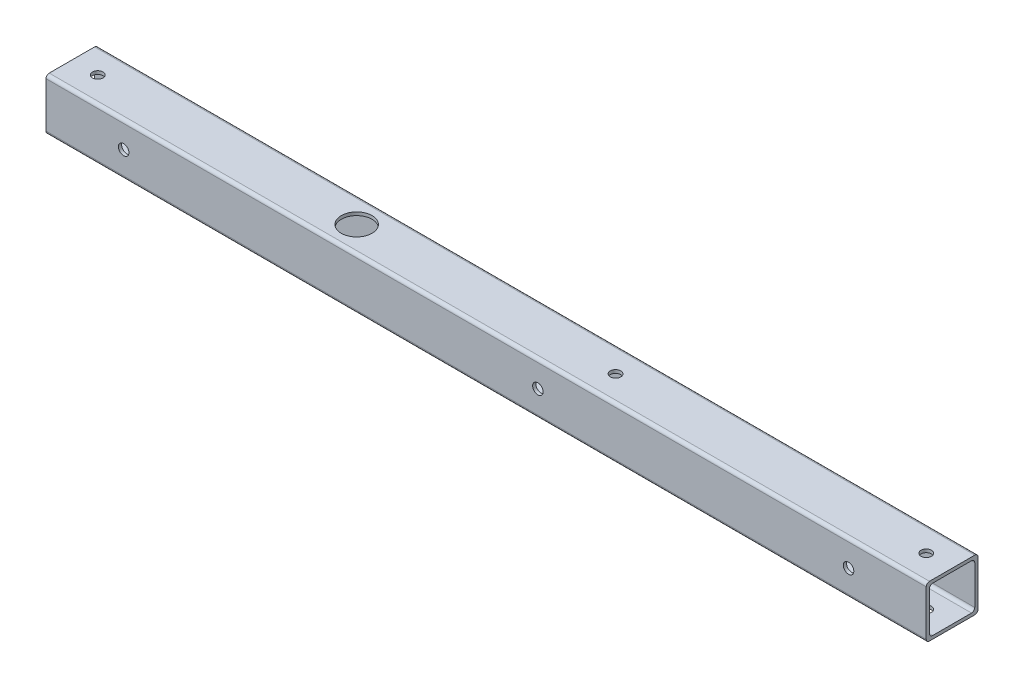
ISO-10303-21;
HEADER;
FILE_DESCRIPTION(('STEP AP214'),'2;1');
FILE_NAME('part.step','',(''),(''),'','','');
FILE_SCHEMA(('AUTOMOTIVE_DESIGN { 1 0 10303 214 1 1 1 1 }'));
ENDSEC;
DATA;
#1=APPLICATION_CONTEXT('core data for automotive mechanical design processes');
#2=APPLICATION_PROTOCOL_DEFINITION('international standard','automotive_design',2000,#1);
#3=PRODUCT_CONTEXT('',#1,'mechanical');
#4=PRODUCT('Part','Part','',(#3));
#5=PRODUCT_RELATED_PRODUCT_CATEGORY('part','',(#4));
#6=PRODUCT_DEFINITION_FORMATION('','',#4);
#7=PRODUCT_DEFINITION_CONTEXT('part definition',#1,'design');
#8=PRODUCT_DEFINITION('design','',#6,#7);
#9=PRODUCT_DEFINITION_SHAPE('','',#8);
#10=(LENGTH_UNIT() NAMED_UNIT(*) SI_UNIT(.MILLI.,.METRE.));
#11=(NAMED_UNIT(*) PLANE_ANGLE_UNIT() SI_UNIT($,.RADIAN.));
#12=(NAMED_UNIT(*) SI_UNIT($,.STERADIAN.) SOLID_ANGLE_UNIT());
#13=UNCERTAINTY_MEASURE_WITH_UNIT(LENGTH_MEASURE(1.E-05),#10,'distance_accuracy_value','');
#14=(GEOMETRIC_REPRESENTATION_CONTEXT(3) GLOBAL_UNCERTAINTY_ASSIGNED_CONTEXT((#13)) GLOBAL_UNIT_ASSIGNED_CONTEXT((#10,
#11,#12)) REPRESENTATION_CONTEXT('',''));
#15=CARTESIAN_POINT('',(0.,0.,0.));
#16=DIRECTION('',(0.,0.,1.));
#17=DIRECTION('',(1.,0.,0.));
#18=AXIS2_PLACEMENT_3D('',#15,#16,#17);
#19=CARTESIAN_POINT('',(0.,101.6,0.));
#20=DIRECTION('',(-1.,0.,0.));
#21=DIRECTION('',(0.,0.,1.));
#22=AXIS2_PLACEMENT_3D('',#19,#20,#21);
#23=PLANE('',#22);
#24=DIRECTION('',(0.,0.,1.));
#25=VECTOR('',#24,1.);
#26=CARTESIAN_POINT('',(0.,95.25,6.35000000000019));
#27=LINE('',#26,#25);
#28=CARTESIAN_POINT('',(0.,95.25,12.7000000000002));
#29=VERTEX_POINT('',#28);
#30=CARTESIAN_POINT('',(0.,95.25,88.9000000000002));
#31=VERTEX_POINT('',#30);
#32=EDGE_CURVE('E169',#29,#31,#27,.T.);
#33=ORIENTED_EDGE('',*,*,#32,.F.);
#34=CARTESIAN_POINT('',(0.,88.9,12.7000000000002));
#35=DIRECTION('',(-1.,0.,0.));
#36=DIRECTION('',(0.,0.,1.));
#37=AXIS2_PLACEMENT_3D('',#34,#35,#36);
#38=CIRCLE('',#37,6.35);
#39=CARTESIAN_POINT('',(0.,88.9,6.35000000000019));
#40=VERTEX_POINT('',#39);
#41=EDGE_CURVE('E179',#29,#40,#38,.T.);
#42=ORIENTED_EDGE('',*,*,#41,.T.);
#43=DIRECTION('',(0.,1.,0.));
#44=VECTOR('',#43,1.);
#45=CARTESIAN_POINT('',(0.,95.25,6.35000000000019));
#46=LINE('',#45,#44);
#47=CARTESIAN_POINT('',(0.,12.7,6.3500000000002));
#48=VERTEX_POINT('',#47);
#49=EDGE_CURVE('E264',#48,#40,#46,.T.);
#50=ORIENTED_EDGE('',*,*,#49,.F.);
#51=CARTESIAN_POINT('',(0.,12.7,12.7000000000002));
#52=DIRECTION('',(-1.,0.,0.));
#53=DIRECTION('',(0.,0.,1.));
#54=AXIS2_PLACEMENT_3D('',#51,#52,#53);
#55=CIRCLE('',#54,6.35);
#56=CARTESIAN_POINT('',(0.,6.35,12.7000000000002));
#57=VERTEX_POINT('',#56);
#58=EDGE_CURVE('E11',#48,#57,#55,.T.);
#59=ORIENTED_EDGE('',*,*,#58,.T.);
#60=DIRECTION('',(0.,0.,-1.));
#61=VECTOR('',#60,1.);
#62=CARTESIAN_POINT('',(0.,6.35,6.35000000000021));
#63=LINE('',#62,#61);
#64=CARTESIAN_POINT('',(0.,6.35,88.9000000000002));
#65=VERTEX_POINT('',#64);
#66=EDGE_CURVE('E277',#65,#57,#63,.T.);
#67=ORIENTED_EDGE('',*,*,#66,.F.);
#68=CARTESIAN_POINT('',(0.,12.7,88.9000000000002));
#69=DIRECTION('',(-1.,0.,0.));
#70=DIRECTION('',(0.,0.,1.));
#71=AXIS2_PLACEMENT_3D('',#68,#69,#70);
#72=CIRCLE('',#71,6.35);
#73=CARTESIAN_POINT('',(0.,12.7,95.2500000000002));
#74=VERTEX_POINT('',#73);
#75=EDGE_CURVE('E168',#65,#74,#72,.T.);
#76=ORIENTED_EDGE('',*,*,#75,.T.);
#77=DIRECTION('',(0.,-1.,0.));
#78=VECTOR('',#77,1.);
#79=CARTESIAN_POINT('',(0.,95.25,95.2500000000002));
#80=LINE('',#79,#78);
#81=CARTESIAN_POINT('',(0.,88.9,95.2500000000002));
#82=VERTEX_POINT('',#81);
#83=EDGE_CURVE('E152',#82,#74,#80,.T.);
#84=ORIENTED_EDGE('',*,*,#83,.F.);
#85=CARTESIAN_POINT('',(0.,88.9,88.9000000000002));
#86=DIRECTION('',(-1.,0.,0.));
#87=DIRECTION('',(0.,0.,1.));
#88=AXIS2_PLACEMENT_3D('',#85,#86,#87);
#89=CIRCLE('',#88,6.35);
#90=EDGE_CURVE('E164',#82,#31,#89,.T.);
#91=ORIENTED_EDGE('',*,*,#90,.T.);
#92=EDGE_LOOP('',(#33,#42,#50,#59,#67,#76,#84,#91));
#93=FACE_BOUND('',#92,.T.);
#94=DIRECTION('',(0.,-1.,0.));
#95=VECTOR('',#94,1.);
#96=CARTESIAN_POINT('',(0.,101.6,101.6));
#97=LINE('',#96,#95);
#98=CARTESIAN_POINT('',(0.,95.25,101.6));
#99=VERTEX_POINT('',#98);
#100=CARTESIAN_POINT('',(0.,6.34999999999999,101.6));
#101=VERTEX_POINT('',#100);
#102=EDGE_CURVE('E288',#99,#101,#97,.T.);
#103=ORIENTED_EDGE('',*,*,#102,.T.);
#104=CARTESIAN_POINT('',(0.,6.34999999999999,95.25));
#105=DIRECTION('',(-1.,0.,0.));
#106=DIRECTION('',(0.,0.,1.));
#107=AXIS2_PLACEMENT_3D('',#104,#105,#106);
#108=CIRCLE('',#107,6.35);
#109=CARTESIAN_POINT('',(0.,0.,95.25));
#110=VERTEX_POINT('',#109);
#111=EDGE_CURVE('E319',#101,#110,#108,.F.);
#112=ORIENTED_EDGE('',*,*,#111,.T.);
#113=DIRECTION('',(0.,0.,-1.));
#114=VECTOR('',#113,1.);
#115=CARTESIAN_POINT('',(0.,0.,0.));
#116=LINE('',#115,#114);
#117=CARTESIAN_POINT('',(0.,0.,6.35));
#118=VERTEX_POINT('',#117);
#119=EDGE_CURVE('E280',#110,#118,#116,.T.);
#120=ORIENTED_EDGE('',*,*,#119,.T.);
#121=CARTESIAN_POINT('',(0.,6.34999999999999,6.35));
#122=DIRECTION('',(-1.,0.,0.));
#123=DIRECTION('',(0.,0.,1.));
#124=AXIS2_PLACEMENT_3D('',#121,#122,#123);
#125=CIRCLE('',#124,6.35);
#126=CARTESIAN_POINT('',(0.,6.34999999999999,0.));
#127=VERTEX_POINT('',#126);
#128=EDGE_CURVE('E313',#118,#127,#125,.F.);
#129=ORIENTED_EDGE('',*,*,#128,.T.);
#130=DIRECTION('',(0.,-1.,0.));
#131=VECTOR('',#130,1.);
#132=CARTESIAN_POINT('',(0.,101.6,0.));
#133=LINE('',#132,#131);
#134=CARTESIAN_POINT('',(0.,95.25,0.));
#135=VERTEX_POINT('',#134);
#136=EDGE_CURVE('E159',#135,#127,#133,.T.);
#137=ORIENTED_EDGE('',*,*,#136,.F.);
#138=CARTESIAN_POINT('',(0.,95.25,6.35));
#139=DIRECTION('',(-1.,0.,0.));
#140=DIRECTION('',(0.,0.,1.));
#141=AXIS2_PLACEMENT_3D('',#138,#139,#140);
#142=CIRCLE('',#141,6.35);
#143=CARTESIAN_POINT('',(0.,101.6,6.35));
#144=VERTEX_POINT('',#143);
#145=EDGE_CURVE('E315',#135,#144,#142,.F.);
#146=ORIENTED_EDGE('',*,*,#145,.T.);
#147=DIRECTION('',(0.,0.,-1.));
#148=VECTOR('',#147,1.);
#149=CARTESIAN_POINT('',(0.,101.6,0.));
#150=LINE('',#149,#148);
#151=CARTESIAN_POINT('',(0.,101.6,95.25));
#152=VERTEX_POINT('',#151);
#153=EDGE_CURVE('E281',#152,#144,#150,.T.);
#154=ORIENTED_EDGE('',*,*,#153,.F.);
#155=CARTESIAN_POINT('',(0.,95.25,95.25));
#156=DIRECTION('',(-1.,0.,0.));
#157=DIRECTION('',(0.,0.,1.));
#158=AXIS2_PLACEMENT_3D('',#155,#156,#157);
#159=CIRCLE('',#158,6.35);
#160=EDGE_CURVE('E317',#152,#99,#159,.F.);
#161=ORIENTED_EDGE('',*,*,#160,.T.);
#162=EDGE_LOOP('',(#103,#112,#120,#129,#137,#146,#154,#161));
#163=FACE_BOUND('',#162,.T.);
#164=ADVANCED_FACE('F31',(#93,#163),#23,.F.);
#165=CARTESIAN_POINT('',(0.,101.6,0.));
#166=DIRECTION('',(0.,0.,1.));
#167=DIRECTION('',(1.,0.,0.));
#168=AXIS2_PLACEMENT_3D('',#165,#166,#167);
#169=PLANE('',#168);
#170=CARTESIAN_POINT('',(-762.,50.7999999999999,0.));
#171=DIRECTION('',(0.,0.,-1.));
#172=DIRECTION('',(-1.,0.,0.));
#173=AXIS2_PLACEMENT_3D('',#170,#171,#172);
#174=CIRCLE('',#173,10.3187499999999);
#175=CARTESIAN_POINT('',(-772.31875,50.7999999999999,0.));
#176=VERTEX_POINT('',#175);
#177=EDGE_CURVE('E219',#176,#176,#174,.T.);
#178=ORIENTED_EDGE('',*,*,#177,.F.);
#179=EDGE_LOOP('',(#178));
#180=FACE_BOUND('',#179,.T.);
#181=CARTESIAN_POINT('',(-152.4,50.8,0.));
#182=DIRECTION('',(0.,0.,-1.));
#183=DIRECTION('',(-1.,0.,0.));
#184=AXIS2_PLACEMENT_3D('',#181,#182,#183);
#185=CIRCLE('',#184,10.31875);
#186=CARTESIAN_POINT('',(-162.71875,50.8,0.));
#187=VERTEX_POINT('',#186);
#188=EDGE_CURVE('E216',#187,#187,#185,.T.);
#189=ORIENTED_EDGE('',*,*,#188,.F.);
#190=EDGE_LOOP('',(#189));
#191=FACE_BOUND('',#190,.T.);
#192=CARTESIAN_POINT('',(-1574.8,50.8,1.92851008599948E-13));
#193=DIRECTION('',(0.,0.,-1.));
#194=DIRECTION('',(-1.,0.,0.));
#195=AXIS2_PLACEMENT_3D('',#192,#193,#194);
#196=CIRCLE('',#195,10.31875);
#197=CARTESIAN_POINT('',(-1585.11875,50.8,1.94114649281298E-13));
#198=VERTEX_POINT('',#197);
#199=EDGE_CURVE('E235',#198,#198,#196,.T.);
#200=ORIENTED_EDGE('',*,*,#199,.F.);
#201=EDGE_LOOP('',(#200));
#202=FACE_BOUND('',#201,.T.);
#203=DIRECTION('',(0.,-1.,0.));
#204=VECTOR('',#203,1.);
#205=CARTESIAN_POINT('',(-1727.2,101.6,2.11514009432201E-13));
#206=LINE('',#205,#204);
#207=CARTESIAN_POINT('',(-1727.2,95.25,2.11514009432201E-13));
#208=VERTEX_POINT('',#207);
#209=CARTESIAN_POINT('',(-1727.2,6.34999999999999,2.11514009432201E-13));
#210=VERTEX_POINT('',#209);
#211=EDGE_CURVE('E298',#208,#210,#206,.T.);
#212=ORIENTED_EDGE('',*,*,#211,.F.);
#213=DIRECTION('',(-1.,0.,0.));
#214=VECTOR('',#213,1.);
#215=CARTESIAN_POINT('',(0.,95.25,0.));
#216=LINE('',#215,#214);
#217=EDGE_CURVE('E347',#208,#135,#216,.F.);
#218=ORIENTED_EDGE('',*,*,#217,.T.);
#219=ORIENTED_EDGE('',*,*,#136,.T.);
#220=DIRECTION('',(-1.,0.,0.));
#221=VECTOR('',#220,1.);
#222=CARTESIAN_POINT('',(-1727.2,6.34999999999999,2.11514009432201E-13));
#223=LINE('',#222,#221);
#224=EDGE_CURVE('E345',#127,#210,#223,.T.);
#225=ORIENTED_EDGE('',*,*,#224,.T.);
#226=EDGE_LOOP('',(#212,#218,#219,#225));
#227=FACE_BOUND('',#226,.T.);
#228=ADVANCED_FACE('F373',(#180,#191,#202,#227),#169,.F.);
#229=CARTESIAN_POINT('',(-1727.2,101.6,2.11514009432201E-13));
#230=DIRECTION('',(1.,0.,0.));
#231=DIRECTION('',(0.,0.,-1.));
#232=AXIS2_PLACEMENT_3D('',#229,#230,#231);
#233=PLANE('',#232);
#234=DIRECTION('',(0.,0.,1.));
#235=VECTOR('',#234,1.);
#236=CARTESIAN_POINT('',(-1727.2,6.35,6.35000000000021));
#237=LINE('',#236,#235);
#238=CARTESIAN_POINT('',(-1727.2,6.35,12.7000000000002));
#239=VERTEX_POINT('',#238);
#240=CARTESIAN_POINT('',(-1727.2,6.35,88.9000000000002));
#241=VERTEX_POINT('',#240);
#242=EDGE_CURVE('E270',#239,#241,#237,.T.);
#243=ORIENTED_EDGE('',*,*,#242,.F.);
#244=CARTESIAN_POINT('',(-1727.2,12.7,12.7000000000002));
#245=DIRECTION('',(1.,0.,0.));
#246=DIRECTION('',(0.,0.,-1.));
#247=AXIS2_PLACEMENT_3D('',#244,#245,#246);
#248=CIRCLE('',#247,6.35);
#249=CARTESIAN_POINT('',(-1727.2,12.7,6.3500000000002));
#250=VERTEX_POINT('',#249);
#251=EDGE_CURVE('E40',#239,#250,#248,.T.);
#252=ORIENTED_EDGE('',*,*,#251,.T.);
#253=DIRECTION('',(0.,-1.,0.));
#254=VECTOR('',#253,1.);
#255=CARTESIAN_POINT('',(-1727.2,95.25,6.35000000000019));
#256=LINE('',#255,#254);
#257=CARTESIAN_POINT('',(-1727.2,88.9,6.35000000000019));
#258=VERTEX_POINT('',#257);
#259=EDGE_CURVE('E267',#258,#250,#256,.T.);
#260=ORIENTED_EDGE('',*,*,#259,.F.);
#261=CARTESIAN_POINT('',(-1727.2,88.9,12.7000000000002));
#262=DIRECTION('',(1.,0.,0.));
#263=DIRECTION('',(0.,0.,-1.));
#264=AXIS2_PLACEMENT_3D('',#261,#262,#263);
#265=CIRCLE('',#264,6.35);
#266=CARTESIAN_POINT('',(-1727.2,95.25,12.7000000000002));
#267=VERTEX_POINT('',#266);
#268=EDGE_CURVE('E176',#258,#267,#265,.T.);
#269=ORIENTED_EDGE('',*,*,#268,.T.);
#270=DIRECTION('',(0.,0.,-1.));
#271=VECTOR('',#270,1.);
#272=CARTESIAN_POINT('',(-1727.2,95.25,6.35000000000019));
#273=LINE('',#272,#271);
#274=CARTESIAN_POINT('',(-1727.2,95.25,88.9000000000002));
#275=VERTEX_POINT('',#274);
#276=EDGE_CURVE('E274',#275,#267,#273,.T.);
#277=ORIENTED_EDGE('',*,*,#276,.F.);
#278=CARTESIAN_POINT('',(-1727.2,88.9,88.9000000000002));
#279=DIRECTION('',(1.,0.,0.));
#280=DIRECTION('',(0.,0.,-1.));
#281=AXIS2_PLACEMENT_3D('',#278,#279,#280);
#282=CIRCLE('',#281,6.35);
#283=CARTESIAN_POINT('',(-1727.2,88.9,95.2500000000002));
#284=VERTEX_POINT('',#283);
#285=EDGE_CURVE('E177',#275,#284,#282,.T.);
#286=ORIENTED_EDGE('',*,*,#285,.T.);
#287=DIRECTION('',(0.,1.,0.));
#288=VECTOR('',#287,1.);
#289=CARTESIAN_POINT('',(-1727.2,95.25,95.2500000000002));
#290=LINE('',#289,#288);
#291=CARTESIAN_POINT('',(-1727.2,12.7,95.2500000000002));
#292=VERTEX_POINT('',#291);
#293=EDGE_CURVE('E155',#292,#284,#290,.T.);
#294=ORIENTED_EDGE('',*,*,#293,.F.);
#295=CARTESIAN_POINT('',(-1727.2,12.7,88.9000000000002));
#296=DIRECTION('',(1.,0.,0.));
#297=DIRECTION('',(0.,0.,-1.));
#298=AXIS2_PLACEMENT_3D('',#295,#296,#297);
#299=CIRCLE('',#298,6.35);
#300=EDGE_CURVE('E349',#292,#241,#299,.T.);
#301=ORIENTED_EDGE('',*,*,#300,.T.);
#302=EDGE_LOOP('',(#243,#252,#260,#269,#277,#286,#294,#301));
#303=FACE_BOUND('',#302,.T.);
#304=DIRECTION('',(0.,0.,1.));
#305=VECTOR('',#304,1.);
#306=CARTESIAN_POINT('',(-1727.2,0.,2.11514009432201E-13));
#307=LINE('',#306,#305);
#308=CARTESIAN_POINT('',(-1727.2,0.,6.35000000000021));
#309=VERTEX_POINT('',#308);
#310=CARTESIAN_POINT('',(-1727.2,0.,95.2500000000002));
#311=VERTEX_POINT('',#310);
#312=EDGE_CURVE('E285',#309,#311,#307,.T.);
#313=ORIENTED_EDGE('',*,*,#312,.T.);
#314=CARTESIAN_POINT('',(-1727.2,6.34999999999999,95.2500000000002));
#315=DIRECTION('',(1.,0.,0.));
#316=DIRECTION('',(0.,0.,-1.));
#317=AXIS2_PLACEMENT_3D('',#314,#315,#316);
#318=CIRCLE('',#317,6.35);
#319=CARTESIAN_POINT('',(-1727.2,6.34999999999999,101.6));
#320=VERTEX_POINT('',#319);
#321=EDGE_CURVE('E329',#311,#320,#318,.F.);
#322=ORIENTED_EDGE('',*,*,#321,.T.);
#323=DIRECTION('',(0.,-1.,0.));
#324=VECTOR('',#323,1.);
#325=CARTESIAN_POINT('',(-1727.2,101.6,101.6));
#326=LINE('',#325,#324);
#327=CARTESIAN_POINT('',(-1727.2,95.25,101.6));
#328=VERTEX_POINT('',#327);
#329=EDGE_CURVE('E295',#328,#320,#326,.T.);
#330=ORIENTED_EDGE('',*,*,#329,.F.);
#331=CARTESIAN_POINT('',(-1727.2,95.25,95.2500000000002));
#332=DIRECTION('',(1.,0.,0.));
#333=DIRECTION('',(0.,0.,-1.));
#334=AXIS2_PLACEMENT_3D('',#331,#332,#333);
#335=CIRCLE('',#334,6.35);
#336=CARTESIAN_POINT('',(-1727.2,101.6,95.2500000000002));
#337=VERTEX_POINT('',#336);
#338=EDGE_CURVE('E327',#328,#337,#335,.F.);
#339=ORIENTED_EDGE('',*,*,#338,.T.);
#340=DIRECTION('',(0.,0.,1.));
#341=VECTOR('',#340,1.);
#342=CARTESIAN_POINT('',(-1727.2,101.6,2.11514009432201E-13));
#343=LINE('',#342,#341);
#344=CARTESIAN_POINT('',(-1727.2,101.6,6.35000000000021));
#345=VERTEX_POINT('',#344);
#346=EDGE_CURVE('E284',#345,#337,#343,.T.);
#347=ORIENTED_EDGE('',*,*,#346,.F.);
#348=CARTESIAN_POINT('',(-1727.2,95.25,6.35000000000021));
#349=DIRECTION('',(1.,0.,0.));
#350=DIRECTION('',(0.,0.,-1.));
#351=AXIS2_PLACEMENT_3D('',#348,#349,#350);
#352=CIRCLE('',#351,6.35);
#353=EDGE_CURVE('E56',#345,#208,#352,.F.);
#354=ORIENTED_EDGE('',*,*,#353,.T.);
#355=ORIENTED_EDGE('',*,*,#211,.T.);
#356=CARTESIAN_POINT('',(-1727.2,6.34999999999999,6.35000000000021));
#357=DIRECTION('',(1.,0.,0.));
#358=DIRECTION('',(0.,0.,-1.));
#359=AXIS2_PLACEMENT_3D('',#356,#357,#358);
#360=CIRCLE('',#359,6.35);
#361=EDGE_CURVE('E48',#210,#309,#360,.F.);
#362=ORIENTED_EDGE('',*,*,#361,.T.);
#363=EDGE_LOOP('',(#313,#322,#330,#339,#347,#354,#355,#362));
#364=FACE_BOUND('',#363,.T.);
#365=ADVANCED_FACE('F352',(#303,#364),#233,.F.);
#366=CARTESIAN_POINT('',(0.,101.6,101.6));
#367=DIRECTION('',(0.,0.,-1.));
#368=DIRECTION('',(-1.,0.,0.));
#369=AXIS2_PLACEMENT_3D('',#366,#367,#368);
#370=PLANE('',#369);
#371=CARTESIAN_POINT('',(-762.,50.7999999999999,101.6));
#372=DIRECTION('',(0.,0.,-1.));
#373=DIRECTION('',(-1.,0.,0.));
#374=AXIS2_PLACEMENT_3D('',#371,#372,#373);
#375=CIRCLE('',#374,10.3187499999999);
#376=CARTESIAN_POINT('',(-772.31875,50.7999999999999,101.6));
#377=VERTEX_POINT('',#376);
#378=EDGE_CURVE('E212',#377,#377,#375,.T.);
#379=ORIENTED_EDGE('',*,*,#378,.T.);
#380=EDGE_LOOP('',(#379));
#381=FACE_BOUND('',#380,.T.);
#382=CARTESIAN_POINT('',(-152.4,50.8,101.6));
#383=DIRECTION('',(0.,0.,-1.));
#384=DIRECTION('',(-1.,0.,0.));
#385=AXIS2_PLACEMENT_3D('',#382,#383,#384);
#386=CIRCLE('',#385,10.31875);
#387=CARTESIAN_POINT('',(-162.71875,50.8,101.6));
#388=VERTEX_POINT('',#387);
#389=EDGE_CURVE('E208',#388,#388,#386,.T.);
#390=ORIENTED_EDGE('',*,*,#389,.T.);
#391=EDGE_LOOP('',(#390));
#392=FACE_BOUND('',#391,.T.);
#393=CARTESIAN_POINT('',(-1574.8,50.8,101.6));
#394=DIRECTION('',(0.,0.,-1.));
#395=DIRECTION('',(-1.,0.,0.));
#396=AXIS2_PLACEMENT_3D('',#393,#394,#395);
#397=CIRCLE('',#396,10.31875);
#398=CARTESIAN_POINT('',(-1585.11875,50.8,101.6));
#399=VERTEX_POINT('',#398);
#400=EDGE_CURVE('E204',#399,#399,#397,.T.);
#401=ORIENTED_EDGE('',*,*,#400,.T.);
#402=EDGE_LOOP('',(#401));
#403=FACE_BOUND('',#402,.T.);
#404=ORIENTED_EDGE('',*,*,#329,.T.);
#405=DIRECTION('',(1.,0.,0.));
#406=VECTOR('',#405,1.);
#407=CARTESIAN_POINT('',(0.,6.34999999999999,101.6));
#408=LINE('',#407,#406);
#409=EDGE_CURVE('E310',#320,#101,#408,.T.);
#410=ORIENTED_EDGE('',*,*,#409,.T.);
#411=ORIENTED_EDGE('',*,*,#102,.F.);
#412=DIRECTION('',(1.,0.,0.));
#413=VECTOR('',#412,1.);
#414=CARTESIAN_POINT('',(0.,95.25,101.6));
#415=LINE('',#414,#413);
#416=EDGE_CURVE('E308',#99,#328,#415,.F.);
#417=ORIENTED_EDGE('',*,*,#416,.T.);
#418=EDGE_LOOP('',(#404,#410,#411,#417));
#419=FACE_BOUND('',#418,.T.);
#420=ADVANCED_FACE('F382',(#381,#392,#403,#419),#370,.F.);
#421=CARTESIAN_POINT('',(0.,101.6,0.));
#422=DIRECTION('',(0.,-1.,0.));
#423=DIRECTION('',(0.,0.,-1.));
#424=AXIS2_PLACEMENT_3D('',#421,#422,#423);
#425=PLANE('',#424);
#426=CARTESIAN_POINT('',(-660.4,101.6,50.8000000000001));
#427=DIRECTION('',(0.,1.,0.));
#428=DIRECTION('',(0.,0.,1.));
#429=AXIS2_PLACEMENT_3D('',#426,#427,#428);
#430=CIRCLE('',#429,10.31875);
#431=CARTESIAN_POINT('',(-660.4,101.6,61.1187500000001));
#432=VERTEX_POINT('',#431);
#433=EDGE_CURVE('E444',#432,#432,#430,.T.);
#434=ORIENTED_EDGE('',*,*,#433,.F.);
#435=EDGE_LOOP('',(#434));
#436=FACE_BOUND('',#435,.T.);
#437=CARTESIAN_POINT('',(-1168.4,101.6,50.8000000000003));
#438=DIRECTION('',(0.,1.,0.));
#439=DIRECTION('',(0.,0.,1.));
#440=AXIS2_PLACEMENT_3D('',#437,#438,#439);
#441=CIRCLE('',#440,30.1625000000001);
#442=CARTESIAN_POINT('',(-1168.4,101.6,80.9625000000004));
#443=VERTEX_POINT('',#442);
#444=EDGE_CURVE('E242',#443,#443,#441,.T.);
#445=ORIENTED_EDGE('',*,*,#444,.F.);
#446=EDGE_LOOP('',(#445));
#447=FACE_BOUND('',#446,.T.);
#448=CARTESIAN_POINT('',(-50.8,101.6,50.8));
#449=DIRECTION('',(0.,1.,0.));
#450=DIRECTION('',(0.,0.,1.));
#451=AXIS2_PLACEMENT_3D('',#448,#449,#450);
#452=CIRCLE('',#451,10.31875);
#453=CARTESIAN_POINT('',(-50.8,101.6,61.11875));
#454=VERTEX_POINT('',#453);
#455=EDGE_CURVE('E249',#454,#454,#452,.T.);
#456=ORIENTED_EDGE('',*,*,#455,.F.);
#457=EDGE_LOOP('',(#456));
#458=FACE_BOUND('',#457,.T.);
#459=CARTESIAN_POINT('',(-1676.4,101.6,50.8000000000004));
#460=DIRECTION('',(0.,1.,0.));
#461=DIRECTION('',(0.,0.,1.));
#462=AXIS2_PLACEMENT_3D('',#459,#460,#461);
#463=CIRCLE('',#462,10.31875);
#464=CARTESIAN_POINT('',(-1676.4,101.6,61.1187500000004));
#465=VERTEX_POINT('',#464);
#466=EDGE_CURVE('E256',#465,#465,#463,.T.);
#467=ORIENTED_EDGE('',*,*,#466,.F.);
#468=EDGE_LOOP('',(#467));
#469=FACE_BOUND('',#468,.T.);
#470=ORIENTED_EDGE('',*,*,#346,.T.);
#471=DIRECTION('',(1.,0.,0.));
#472=VECTOR('',#471,1.);
#473=CARTESIAN_POINT('',(0.,101.6,95.25));
#474=LINE('',#473,#472);
#475=EDGE_CURVE('E334',#337,#152,#474,.T.);
#476=ORIENTED_EDGE('',*,*,#475,.T.);
#477=ORIENTED_EDGE('',*,*,#153,.T.);
#478=DIRECTION('',(-1.,0.,0.));
#479=VECTOR('',#478,1.);
#480=CARTESIAN_POINT('',(0.,101.6,6.35));
#481=LINE('',#480,#479);
#482=EDGE_CURVE('E331',#144,#345,#481,.T.);
#483=ORIENTED_EDGE('',*,*,#482,.T.);
#484=EDGE_LOOP('',(#470,#476,#477,#483));
#485=FACE_BOUND('',#484,.T.);
#486=ADVANCED_FACE('F385',(#436,#447,#458,#469,#485),#425,.F.);
#487=CARTESIAN_POINT('',(0.,0.,0.));
#488=DIRECTION('',(0.,-1.,0.));
#489=DIRECTION('',(0.,0.,-1.));
#490=AXIS2_PLACEMENT_3D('',#487,#488,#489);
#491=PLANE('',#490);
#492=CARTESIAN_POINT('',(-660.4,0.,50.8000000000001));
#493=DIRECTION('',(0.,1.,0.));
#494=DIRECTION('',(0.,0.,1.));
#495=AXIS2_PLACEMENT_3D('',#492,#493,#494);
#496=CIRCLE('',#495,10.31875);
#497=CARTESIAN_POINT('',(-660.4,0.,61.1187500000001));
#498=VERTEX_POINT('',#497);
#499=EDGE_CURVE('E448',#498,#498,#496,.T.);
#500=ORIENTED_EDGE('',*,*,#499,.T.);
#501=EDGE_LOOP('',(#500));
#502=FACE_BOUND('',#501,.T.);
#503=CARTESIAN_POINT('',(-1168.4,0.,50.8000000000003));
#504=DIRECTION('',(0.,1.,0.));
#505=DIRECTION('',(0.,0.,1.));
#506=AXIS2_PLACEMENT_3D('',#503,#504,#505);
#507=CIRCLE('',#506,30.1625000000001);
#508=CARTESIAN_POINT('',(-1168.4,0.,80.9625000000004));
#509=VERTEX_POINT('',#508);
#510=EDGE_CURVE('E199',#509,#509,#507,.T.);
#511=ORIENTED_EDGE('',*,*,#510,.T.);
#512=EDGE_LOOP('',(#511));
#513=FACE_BOUND('',#512,.T.);
#514=CARTESIAN_POINT('',(-50.8,0.,50.8));
#515=DIRECTION('',(0.,1.,0.));
#516=DIRECTION('',(0.,0.,1.));
#517=AXIS2_PLACEMENT_3D('',#514,#515,#516);
#518=CIRCLE('',#517,10.31875);
#519=CARTESIAN_POINT('',(-50.8,0.,61.11875));
#520=VERTEX_POINT('',#519);
#521=EDGE_CURVE('E194',#520,#520,#518,.T.);
#522=ORIENTED_EDGE('',*,*,#521,.T.);
#523=EDGE_LOOP('',(#522));
#524=FACE_BOUND('',#523,.T.);
#525=CARTESIAN_POINT('',(-1676.4,0.,50.8000000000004));
#526=DIRECTION('',(0.,1.,0.));
#527=DIRECTION('',(0.,0.,1.));
#528=AXIS2_PLACEMENT_3D('',#525,#526,#527);
#529=CIRCLE('',#528,10.31875);
#530=CARTESIAN_POINT('',(-1676.4,0.,61.1187500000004));
#531=VERTEX_POINT('',#530);
#532=EDGE_CURVE('E189',#531,#531,#529,.T.);
#533=ORIENTED_EDGE('',*,*,#532,.T.);
#534=EDGE_LOOP('',(#533));
#535=FACE_BOUND('',#534,.T.);
#536=ORIENTED_EDGE('',*,*,#119,.F.);
#537=DIRECTION('',(1.,0.,0.));
#538=VECTOR('',#537,1.);
#539=CARTESIAN_POINT('',(-1727.2,0.,95.2500000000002));
#540=LINE('',#539,#538);
#541=EDGE_CURVE('E323',#110,#311,#540,.F.);
#542=ORIENTED_EDGE('',*,*,#541,.T.);
#543=ORIENTED_EDGE('',*,*,#312,.F.);
#544=DIRECTION('',(-1.,0.,0.));
#545=VECTOR('',#544,1.);
#546=CARTESIAN_POINT('',(0.,0.,6.35));
#547=LINE('',#546,#545);
#548=EDGE_CURVE('E321',#309,#118,#547,.F.);
#549=ORIENTED_EDGE('',*,*,#548,.T.);
#550=EDGE_LOOP('',(#536,#542,#543,#549));
#551=FACE_BOUND('',#550,.T.);
#552=ADVANCED_FACE('F386',(#502,#513,#524,#535,#551),#491,.T.);
#553=CARTESIAN_POINT('',(0.000999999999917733,95.25,6.35000000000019));
#554=DIRECTION('',(0.,0.,-1.));
#555=DIRECTION('',(0.,1.,0.));
#556=AXIS2_PLACEMENT_3D('',#553,#554,#555);
#557=PLANE('',#556);
#558=CARTESIAN_POINT('',(-762.,50.7999999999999,6.3500000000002));
#559=DIRECTION('',(0.,0.,-1.));
#560=DIRECTION('',(0.,1.,0.));
#561=AXIS2_PLACEMENT_3D('',#558,#559,#560);
#562=CIRCLE('',#561,10.3187499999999);
#563=CARTESIAN_POINT('',(-762.,61.1187499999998,6.3500000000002));
#564=VERTEX_POINT('',#563);
#565=EDGE_CURVE('E211',#564,#564,#562,.T.);
#566=ORIENTED_EDGE('',*,*,#565,.T.);
#567=EDGE_LOOP('',(#566));
#568=FACE_BOUND('',#567,.T.);
#569=CARTESIAN_POINT('',(-152.4,50.8,6.3500000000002));
#570=DIRECTION('',(0.,0.,-1.));
#571=DIRECTION('',(0.,1.,0.));
#572=AXIS2_PLACEMENT_3D('',#569,#570,#571);
#573=CIRCLE('',#572,10.31875);
#574=CARTESIAN_POINT('',(-152.4,61.11875,6.3500000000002));
#575=VERTEX_POINT('',#574);
#576=EDGE_CURVE('E207',#575,#575,#573,.T.);
#577=ORIENTED_EDGE('',*,*,#576,.T.);
#578=EDGE_LOOP('',(#577));
#579=FACE_BOUND('',#578,.T.);
#580=CARTESIAN_POINT('',(-1574.8,50.8,6.3500000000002));
#581=DIRECTION('',(0.,0.,-1.));
#582=DIRECTION('',(0.,1.,0.));
#583=AXIS2_PLACEMENT_3D('',#580,#581,#582);
#584=CIRCLE('',#583,10.31875);
#585=CARTESIAN_POINT('',(-1574.8,61.11875,6.3500000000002));
#586=VERTEX_POINT('',#585);
#587=EDGE_CURVE('E203',#586,#586,#584,.T.);
#588=ORIENTED_EDGE('',*,*,#587,.T.);
#589=EDGE_LOOP('',(#588));
#590=FACE_BOUND('',#589,.T.);
#591=ORIENTED_EDGE('',*,*,#49,.T.);
#592=DIRECTION('',(-1.,0.,0.));
#593=VECTOR('',#592,1.);
#594=CARTESIAN_POINT('',(-1727.2,88.9,6.35000000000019));
#595=LINE('',#594,#593);
#596=EDGE_CURVE('E342',#40,#258,#595,.T.);
#597=ORIENTED_EDGE('',*,*,#596,.T.);
#598=ORIENTED_EDGE('',*,*,#259,.T.);
#599=DIRECTION('',(-1.,0.,0.));
#600=VECTOR('',#599,1.);
#601=CARTESIAN_POINT('',(0.,12.7,6.3500000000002));
#602=LINE('',#601,#600);
#603=EDGE_CURVE('E340',#250,#48,#602,.F.);
#604=ORIENTED_EDGE('',*,*,#603,.T.);
#605=EDGE_LOOP('',(#591,#597,#598,#604));
#606=FACE_BOUND('',#605,.T.);
#607=ADVANCED_FACE('F389',(#568,#579,#590,#606),#557,.F.);
#608=CARTESIAN_POINT('',(0.000999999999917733,95.25,6.35000000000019));
#609=DIRECTION('',(0.,1.,0.));
#610=DIRECTION('',(0.,0.,1.));
#611=AXIS2_PLACEMENT_3D('',#608,#609,#610);
#612=PLANE('',#611);
#613=CARTESIAN_POINT('',(-660.4,95.25,50.8000000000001));
#614=DIRECTION('',(0.,1.,0.));
#615=DIRECTION('',(0.,0.,1.));
#616=AXIS2_PLACEMENT_3D('',#613,#614,#615);
#617=CIRCLE('',#616,10.31875);
#618=CARTESIAN_POINT('',(-660.4,95.25,61.1187500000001));
#619=VERTEX_POINT('',#618);
#620=EDGE_CURVE('E224',#619,#619,#617,.T.);
#621=ORIENTED_EDGE('',*,*,#620,.T.);
#622=EDGE_LOOP('',(#621));
#623=FACE_BOUND('',#622,.T.);
#624=CARTESIAN_POINT('',(-1168.4,95.25,50.8000000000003));
#625=DIRECTION('',(0.,1.,0.));
#626=DIRECTION('',(0.,0.,1.));
#627=AXIS2_PLACEMENT_3D('',#624,#625,#626);
#628=CIRCLE('',#627,30.1625000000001);
#629=CARTESIAN_POINT('',(-1168.4,95.25,80.9625000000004));
#630=VERTEX_POINT('',#629);
#631=EDGE_CURVE('E198',#630,#630,#628,.T.);
#632=ORIENTED_EDGE('',*,*,#631,.T.);
#633=EDGE_LOOP('',(#632));
#634=FACE_BOUND('',#633,.T.);
#635=CARTESIAN_POINT('',(-50.8,95.25,50.8));
#636=DIRECTION('',(0.,1.,0.));
#637=DIRECTION('',(0.,0.,1.));
#638=AXIS2_PLACEMENT_3D('',#635,#636,#637);
#639=CIRCLE('',#638,10.31875);
#640=CARTESIAN_POINT('',(-50.8,95.25,61.11875));
#641=VERTEX_POINT('',#640);
#642=EDGE_CURVE('E193',#641,#641,#639,.T.);
#643=ORIENTED_EDGE('',*,*,#642,.T.);
#644=EDGE_LOOP('',(#643));
#645=FACE_BOUND('',#644,.T.);
#646=CARTESIAN_POINT('',(-1676.4,95.25,50.8000000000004));
#647=DIRECTION('',(0.,1.,0.));
#648=DIRECTION('',(0.,0.,1.));
#649=AXIS2_PLACEMENT_3D('',#646,#647,#648);
#650=CIRCLE('',#649,10.31875);
#651=CARTESIAN_POINT('',(-1676.4,95.25,61.1187500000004));
#652=VERTEX_POINT('',#651);
#653=EDGE_CURVE('E170',#652,#652,#650,.T.);
#654=ORIENTED_EDGE('',*,*,#653,.T.);
#655=EDGE_LOOP('',(#654));
#656=FACE_BOUND('',#655,.T.);
#657=ORIENTED_EDGE('',*,*,#32,.T.);
#658=DIRECTION('',(-1.,0.,0.));
#659=VECTOR('',#658,1.);
#660=CARTESIAN_POINT('',(-1727.2,95.25,88.9000000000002));
#661=LINE('',#660,#659);
#662=EDGE_CURVE('E175',#31,#275,#661,.T.);
#663=ORIENTED_EDGE('',*,*,#662,.T.);
#664=ORIENTED_EDGE('',*,*,#276,.T.);
#665=DIRECTION('',(-1.,0.,0.));
#666=VECTOR('',#665,1.);
#667=CARTESIAN_POINT('',(0.,95.25,12.7000000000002));
#668=LINE('',#667,#666);
#669=EDGE_CURVE('E337',#267,#29,#668,.F.);
#670=ORIENTED_EDGE('',*,*,#669,.T.);
#671=EDGE_LOOP('',(#657,#663,#664,#670));
#672=FACE_BOUND('',#671,.T.);
#673=ADVANCED_FACE('F395',(#623,#634,#645,#656,#672),#612,.F.);
#674=CARTESIAN_POINT('',(0.000999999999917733,95.25,95.2500000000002));
#675=DIRECTION('',(0.,0.,1.));
#676=DIRECTION('',(0.,-1.,0.));
#677=AXIS2_PLACEMENT_3D('',#674,#675,#676);
#678=PLANE('',#677);
#679=CARTESIAN_POINT('',(-762.,50.7999999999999,95.2500000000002));
#680=DIRECTION('',(0.,0.,1.));
#681=DIRECTION('',(0.,-1.,0.));
#682=AXIS2_PLACEMENT_3D('',#679,#680,#681);
#683=CIRCLE('',#682,10.3187499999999);
#684=CARTESIAN_POINT('',(-762.,40.48125,95.2500000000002));
#685=VERTEX_POINT('',#684);
#686=EDGE_CURVE('E209',#685,#685,#683,.T.);
#687=ORIENTED_EDGE('',*,*,#686,.T.);
#688=EDGE_LOOP('',(#687));
#689=FACE_BOUND('',#688,.T.);
#690=CARTESIAN_POINT('',(-152.4,50.8,95.2500000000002));
#691=DIRECTION('',(0.,0.,1.));
#692=DIRECTION('',(0.,-1.,0.));
#693=AXIS2_PLACEMENT_3D('',#690,#691,#692);
#694=CIRCLE('',#693,10.31875);
#695=CARTESIAN_POINT('',(-152.4,40.48125,95.2500000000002));
#696=VERTEX_POINT('',#695);
#697=EDGE_CURVE('E205',#696,#696,#694,.T.);
#698=ORIENTED_EDGE('',*,*,#697,.T.);
#699=EDGE_LOOP('',(#698));
#700=FACE_BOUND('',#699,.T.);
#701=CARTESIAN_POINT('',(-1574.8,50.8,95.2500000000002));
#702=DIRECTION('',(0.,0.,1.));
#703=DIRECTION('',(0.,-1.,0.));
#704=AXIS2_PLACEMENT_3D('',#701,#702,#703);
#705=CIRCLE('',#704,10.31875);
#706=CARTESIAN_POINT('',(-1574.8,40.4812499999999,95.2500000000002));
#707=VERTEX_POINT('',#706);
#708=EDGE_CURVE('E200',#707,#707,#705,.T.);
#709=ORIENTED_EDGE('',*,*,#708,.T.);
#710=EDGE_LOOP('',(#709));
#711=FACE_BOUND('',#710,.T.);
#712=ORIENTED_EDGE('',*,*,#83,.T.);
#713=DIRECTION('',(-1.,0.,0.));
#714=VECTOR('',#713,1.);
#715=CARTESIAN_POINT('',(-1727.2,12.7,95.2500000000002));
#716=LINE('',#715,#714);
#717=EDGE_CURVE('E158',#74,#292,#716,.T.);
#718=ORIENTED_EDGE('',*,*,#717,.T.);
#719=ORIENTED_EDGE('',*,*,#293,.T.);
#720=DIRECTION('',(-1.,0.,0.));
#721=VECTOR('',#720,1.);
#722=CARTESIAN_POINT('',(0.,88.9,95.2500000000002));
#723=LINE('',#722,#721);
#724=EDGE_CURVE('E148',#284,#82,#723,.F.);
#725=ORIENTED_EDGE('',*,*,#724,.T.);
#726=EDGE_LOOP('',(#712,#718,#719,#725));
#727=FACE_BOUND('',#726,.T.);
#728=ADVANCED_FACE('F150',(#689,#700,#711,#727),#678,.F.);
#729=CARTESIAN_POINT('',(0.000999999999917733,6.35,6.35000000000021));
#730=DIRECTION('',(0.,-1.,0.));
#731=DIRECTION('',(0.,0.,-1.));
#732=AXIS2_PLACEMENT_3D('',#729,#730,#731);
#733=PLANE('',#732);
#734=CARTESIAN_POINT('',(-660.4,6.35,50.8000000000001));
#735=DIRECTION('',(0.,-1.,0.));
#736=DIRECTION('',(0.,0.,-1.));
#737=AXIS2_PLACEMENT_3D('',#734,#735,#736);
#738=CIRCLE('',#737,10.31875);
#739=CARTESIAN_POINT('',(-660.4,6.35,40.48125));
#740=VERTEX_POINT('',#739);
#741=EDGE_CURVE('E35',#740,#740,#738,.T.);
#742=ORIENTED_EDGE('',*,*,#741,.T.);
#743=EDGE_LOOP('',(#742));
#744=FACE_BOUND('',#743,.T.);
#745=CARTESIAN_POINT('',(-1168.4,6.35,50.8000000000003));
#746=DIRECTION('',(0.,-1.,0.));
#747=DIRECTION('',(0.,0.,-1.));
#748=AXIS2_PLACEMENT_3D('',#745,#746,#747);
#749=CIRCLE('',#748,30.1625000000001);
#750=CARTESIAN_POINT('',(-1168.4,6.35,20.6375000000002));
#751=VERTEX_POINT('',#750);
#752=EDGE_CURVE('E195',#751,#751,#749,.T.);
#753=ORIENTED_EDGE('',*,*,#752,.T.);
#754=EDGE_LOOP('',(#753));
#755=FACE_BOUND('',#754,.T.);
#756=CARTESIAN_POINT('',(-50.8,6.35,50.8));
#757=DIRECTION('',(0.,-1.,0.));
#758=DIRECTION('',(0.,0.,-1.));
#759=AXIS2_PLACEMENT_3D('',#756,#757,#758);
#760=CIRCLE('',#759,10.31875);
#761=CARTESIAN_POINT('',(-50.8,6.35,40.48125));
#762=VERTEX_POINT('',#761);
#763=EDGE_CURVE('E190',#762,#762,#760,.T.);
#764=ORIENTED_EDGE('',*,*,#763,.T.);
#765=EDGE_LOOP('',(#764));
#766=FACE_BOUND('',#765,.T.);
#767=CARTESIAN_POINT('',(-1676.4,6.35,50.8000000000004));
#768=DIRECTION('',(0.,-1.,0.));
#769=DIRECTION('',(0.,0.,-1.));
#770=AXIS2_PLACEMENT_3D('',#767,#768,#769);
#771=CIRCLE('',#770,10.31875);
#772=CARTESIAN_POINT('',(-1676.4,6.35,40.4812500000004));
#773=VERTEX_POINT('',#772);
#774=EDGE_CURVE('E186',#773,#773,#771,.T.);
#775=ORIENTED_EDGE('',*,*,#774,.T.);
#776=EDGE_LOOP('',(#775));
#777=FACE_BOUND('',#776,.T.);
#778=ORIENTED_EDGE('',*,*,#242,.T.);
#779=DIRECTION('',(-1.,0.,0.));
#780=VECTOR('',#779,1.);
#781=CARTESIAN_POINT('',(0.,6.35,88.9000000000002));
#782=LINE('',#781,#780);
#783=EDGE_CURVE('E306',#241,#65,#782,.F.);
#784=ORIENTED_EDGE('',*,*,#783,.T.);
#785=ORIENTED_EDGE('',*,*,#66,.T.);
#786=DIRECTION('',(-1.,0.,0.));
#787=VECTOR('',#786,1.);
#788=CARTESIAN_POINT('',(-1727.2,6.35,12.7000000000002));
#789=LINE('',#788,#787);
#790=EDGE_CURVE('E303',#57,#239,#789,.T.);
#791=ORIENTED_EDGE('',*,*,#790,.T.);
#792=EDGE_LOOP('',(#778,#784,#785,#791));
#793=FACE_BOUND('',#792,.T.);
#794=ADVANCED_FACE('F356',(#744,#755,#766,#777,#793),#733,.F.);
#795=CARTESIAN_POINT('',(0.000999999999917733,12.7,88.9000000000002));
#796=DIRECTION('',(1.,0.,0.));
#797=DIRECTION('',(0.,0.,-1.));
#798=AXIS2_PLACEMENT_3D('',#795,#796,#797);
#799=CYLINDRICAL_SURFACE('',#798,6.35);
#800=ORIENTED_EDGE('',*,*,#75,.F.);
#801=ORIENTED_EDGE('',*,*,#783,.F.);
#802=ORIENTED_EDGE('',*,*,#300,.F.);
#803=ORIENTED_EDGE('',*,*,#717,.F.);
#804=EDGE_LOOP('',(#800,#801,#802,#803));
#805=FACE_BOUND('',#804,.T.);
#806=ADVANCED_FACE('F358',(#805),#799,.F.);
#807=CARTESIAN_POINT('',(0.,6.34999999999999,95.25));
#808=DIRECTION('',(-1.,0.,0.));
#809=DIRECTION('',(0.,0.,1.));
#810=AXIS2_PLACEMENT_3D('',#807,#808,#809);
#811=CYLINDRICAL_SURFACE('',#810,6.35);
#812=ORIENTED_EDGE('',*,*,#321,.F.);
#813=ORIENTED_EDGE('',*,*,#541,.F.);
#814=ORIENTED_EDGE('',*,*,#111,.F.);
#815=ORIENTED_EDGE('',*,*,#409,.F.);
#816=EDGE_LOOP('',(#812,#813,#814,#815));
#817=FACE_BOUND('',#816,.T.);
#818=ADVANCED_FACE('F360',(#817),#811,.T.);
#819=CARTESIAN_POINT('',(0.,95.25,95.25));
#820=DIRECTION('',(1.,0.,0.));
#821=DIRECTION('',(0.,0.,-1.));
#822=AXIS2_PLACEMENT_3D('',#819,#820,#821);
#823=CYLINDRICAL_SURFACE('',#822,6.35);
#824=ORIENTED_EDGE('',*,*,#338,.F.);
#825=ORIENTED_EDGE('',*,*,#416,.F.);
#826=ORIENTED_EDGE('',*,*,#160,.F.);
#827=ORIENTED_EDGE('',*,*,#475,.F.);
#828=EDGE_LOOP('',(#824,#825,#826,#827));
#829=FACE_BOUND('',#828,.T.);
#830=ADVANCED_FACE('F366',(#829),#823,.T.);
#831=CARTESIAN_POINT('',(0.000999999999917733,88.9,88.9000000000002));
#832=DIRECTION('',(1.,0.,0.));
#833=DIRECTION('',(0.,0.,-1.));
#834=AXIS2_PLACEMENT_3D('',#831,#832,#833);
#835=CYLINDRICAL_SURFACE('',#834,6.35);
#836=ORIENTED_EDGE('',*,*,#90,.F.);
#837=ORIENTED_EDGE('',*,*,#724,.F.);
#838=ORIENTED_EDGE('',*,*,#285,.F.);
#839=ORIENTED_EDGE('',*,*,#662,.F.);
#840=EDGE_LOOP('',(#836,#837,#838,#839));
#841=FACE_BOUND('',#840,.T.);
#842=ADVANCED_FACE('F173',(#841),#835,.F.);
#843=CARTESIAN_POINT('',(0.000999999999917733,88.9,12.7000000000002));
#844=DIRECTION('',(1.,0.,0.));
#845=DIRECTION('',(0.,0.,-1.));
#846=AXIS2_PLACEMENT_3D('',#843,#844,#845);
#847=CYLINDRICAL_SURFACE('',#846,6.35);
#848=ORIENTED_EDGE('',*,*,#41,.F.);
#849=ORIENTED_EDGE('',*,*,#669,.F.);
#850=ORIENTED_EDGE('',*,*,#268,.F.);
#851=ORIENTED_EDGE('',*,*,#596,.F.);
#852=EDGE_LOOP('',(#848,#849,#850,#851));
#853=FACE_BOUND('',#852,.T.);
#854=ADVANCED_FACE('F494',(#853),#847,.F.);
#855=CARTESIAN_POINT('',(0.,95.25,6.35));
#856=DIRECTION('',(-1.,0.,0.));
#857=DIRECTION('',(0.,0.,1.));
#858=AXIS2_PLACEMENT_3D('',#855,#856,#857);
#859=CYLINDRICAL_SURFACE('',#858,6.35);
#860=ORIENTED_EDGE('',*,*,#145,.F.);
#861=ORIENTED_EDGE('',*,*,#217,.F.);
#862=ORIENTED_EDGE('',*,*,#353,.F.);
#863=ORIENTED_EDGE('',*,*,#482,.F.);
#864=EDGE_LOOP('',(#860,#861,#862,#863));
#865=FACE_BOUND('',#864,.T.);
#866=ADVANCED_FACE('F479',(#865),#859,.T.);
#867=CARTESIAN_POINT('',(0.000999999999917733,12.7,12.7000000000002));
#868=DIRECTION('',(1.,0.,0.));
#869=DIRECTION('',(0.,0.,-1.));
#870=AXIS2_PLACEMENT_3D('',#867,#868,#869);
#871=CYLINDRICAL_SURFACE('',#870,6.35);
#872=ORIENTED_EDGE('',*,*,#58,.F.);
#873=ORIENTED_EDGE('',*,*,#603,.F.);
#874=ORIENTED_EDGE('',*,*,#251,.F.);
#875=ORIENTED_EDGE('',*,*,#790,.F.);
#876=EDGE_LOOP('',(#872,#873,#874,#875));
#877=FACE_BOUND('',#876,.T.);
#878=ADVANCED_FACE('F484',(#877),#871,.F.);
#879=CARTESIAN_POINT('',(0.,6.34999999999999,6.35));
#880=DIRECTION('',(1.,0.,0.));
#881=DIRECTION('',(0.,0.,-1.));
#882=AXIS2_PLACEMENT_3D('',#879,#880,#881);
#883=CYLINDRICAL_SURFACE('',#882,6.35);
#884=ORIENTED_EDGE('',*,*,#128,.F.);
#885=ORIENTED_EDGE('',*,*,#548,.F.);
#886=ORIENTED_EDGE('',*,*,#361,.F.);
#887=ORIENTED_EDGE('',*,*,#224,.F.);
#888=EDGE_LOOP('',(#884,#885,#886,#887));
#889=FACE_BOUND('',#888,.T.);
#890=ADVANCED_FACE('F33',(#889),#883,.T.);
#891=CARTESIAN_POINT('',(-1676.4,0.,50.8000000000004));
#892=DIRECTION('',(0.,1.,0.));
#893=DIRECTION('',(0.,0.,1.));
#894=AXIS2_PLACEMENT_3D('',#891,#892,#893);
#895=CYLINDRICAL_SURFACE('',#894,10.31875);
#896=ORIENTED_EDGE('',*,*,#532,.F.);
#897=EDGE_LOOP('',(#896));
#898=FACE_BOUND('',#897,.T.);
#899=ORIENTED_EDGE('',*,*,#774,.F.);
#900=EDGE_LOOP('',(#899));
#901=FACE_BOUND('',#900,.T.);
#902=ADVANCED_FACE('F407',(#898,#901),#895,.F.);
#903=ORIENTED_EDGE('',*,*,#466,.T.);
#904=EDGE_LOOP('',(#903));
#905=FACE_BOUND('',#904,.T.);
#906=ORIENTED_EDGE('',*,*,#653,.F.);
#907=EDGE_LOOP('',(#906));
#908=FACE_BOUND('',#907,.T.);
#909=ADVANCED_FACE('F403',(#905,#908),#895,.F.);
#910=CARTESIAN_POINT('',(-50.8,0.,50.8));
#911=DIRECTION('',(0.,1.,0.));
#912=DIRECTION('',(0.,0.,1.));
#913=AXIS2_PLACEMENT_3D('',#910,#911,#912);
#914=CYLINDRICAL_SURFACE('',#913,10.31875);
#915=ORIENTED_EDGE('',*,*,#521,.F.);
#916=EDGE_LOOP('',(#915));
#917=FACE_BOUND('',#916,.T.);
#918=ORIENTED_EDGE('',*,*,#763,.F.);
#919=EDGE_LOOP('',(#918));
#920=FACE_BOUND('',#919,.T.);
#921=ADVANCED_FACE('F406',(#917,#920),#914,.F.);
#922=ORIENTED_EDGE('',*,*,#455,.T.);
#923=EDGE_LOOP('',(#922));
#924=FACE_BOUND('',#923,.T.);
#925=ORIENTED_EDGE('',*,*,#642,.F.);
#926=EDGE_LOOP('',(#925));
#927=FACE_BOUND('',#926,.T.);
#928=ADVANCED_FACE('F409',(#924,#927),#914,.F.);
#929=CARTESIAN_POINT('',(-1168.4,0.,50.8000000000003));
#930=DIRECTION('',(0.,1.,0.));
#931=DIRECTION('',(0.,0.,1.));
#932=AXIS2_PLACEMENT_3D('',#929,#930,#931);
#933=CYLINDRICAL_SURFACE('',#932,30.1625000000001);
#934=ORIENTED_EDGE('',*,*,#510,.F.);
#935=EDGE_LOOP('',(#934));
#936=FACE_BOUND('',#935,.T.);
#937=ORIENTED_EDGE('',*,*,#752,.F.);
#938=EDGE_LOOP('',(#937));
#939=FACE_BOUND('',#938,.T.);
#940=ADVANCED_FACE('F412',(#936,#939),#933,.F.);
#941=ORIENTED_EDGE('',*,*,#444,.T.);
#942=EDGE_LOOP('',(#941));
#943=FACE_BOUND('',#942,.T.);
#944=ORIENTED_EDGE('',*,*,#631,.F.);
#945=EDGE_LOOP('',(#944));
#946=FACE_BOUND('',#945,.T.);
#947=ADVANCED_FACE('F414',(#943,#946),#933,.F.);
#948=CARTESIAN_POINT('',(-1574.8,50.8,101.6));
#949=DIRECTION('',(0.,0.,-1.));
#950=DIRECTION('',(-1.,0.,0.));
#951=AXIS2_PLACEMENT_3D('',#948,#949,#950);
#952=CYLINDRICAL_SURFACE('',#951,10.31875);
#953=ORIENTED_EDGE('',*,*,#400,.F.);
#954=EDGE_LOOP('',(#953));
#955=FACE_BOUND('',#954,.T.);
#956=ORIENTED_EDGE('',*,*,#708,.F.);
#957=EDGE_LOOP('',(#956));
#958=FACE_BOUND('',#957,.T.);
#959=ADVANCED_FACE('F417',(#955,#958),#952,.F.);
#960=ORIENTED_EDGE('',*,*,#199,.T.);
#961=EDGE_LOOP('',(#960));
#962=FACE_BOUND('',#961,.T.);
#963=ORIENTED_EDGE('',*,*,#587,.F.);
#964=EDGE_LOOP('',(#963));
#965=FACE_BOUND('',#964,.T.);
#966=ADVANCED_FACE('F419',(#962,#965),#952,.F.);
#967=CARTESIAN_POINT('',(-152.4,50.8,101.6));
#968=DIRECTION('',(0.,0.,-1.));
#969=DIRECTION('',(-1.,0.,0.));
#970=AXIS2_PLACEMENT_3D('',#967,#968,#969);
#971=CYLINDRICAL_SURFACE('',#970,10.31875);
#972=ORIENTED_EDGE('',*,*,#389,.F.);
#973=EDGE_LOOP('',(#972));
#974=FACE_BOUND('',#973,.T.);
#975=ORIENTED_EDGE('',*,*,#697,.F.);
#976=EDGE_LOOP('',(#975));
#977=FACE_BOUND('',#976,.T.);
#978=ADVANCED_FACE('F422',(#974,#977),#971,.F.);
#979=ORIENTED_EDGE('',*,*,#188,.T.);
#980=EDGE_LOOP('',(#979));
#981=FACE_BOUND('',#980,.T.);
#982=ORIENTED_EDGE('',*,*,#576,.F.);
#983=EDGE_LOOP('',(#982));
#984=FACE_BOUND('',#983,.T.);
#985=ADVANCED_FACE('F424',(#981,#984),#971,.F.);
#986=CARTESIAN_POINT('',(-762.,50.7999999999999,101.6));
#987=DIRECTION('',(0.,0.,-1.));
#988=DIRECTION('',(-1.,0.,0.));
#989=AXIS2_PLACEMENT_3D('',#986,#987,#988);
#990=CYLINDRICAL_SURFACE('',#989,10.3187499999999);
#991=ORIENTED_EDGE('',*,*,#378,.F.);
#992=EDGE_LOOP('',(#991));
#993=FACE_BOUND('',#992,.T.);
#994=ORIENTED_EDGE('',*,*,#686,.F.);
#995=EDGE_LOOP('',(#994));
#996=FACE_BOUND('',#995,.T.);
#997=ADVANCED_FACE('F427',(#993,#996),#990,.F.);
#998=ORIENTED_EDGE('',*,*,#177,.T.);
#999=EDGE_LOOP('',(#998));
#1000=FACE_BOUND('',#999,.T.);
#1001=ORIENTED_EDGE('',*,*,#565,.F.);
#1002=EDGE_LOOP('',(#1001));
#1003=FACE_BOUND('',#1002,.T.);
#1004=ADVANCED_FACE('F429',(#1000,#1003),#990,.F.);
#1005=CARTESIAN_POINT('',(-660.4,0.,50.8000000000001));
#1006=DIRECTION('',(0.,1.,0.));
#1007=DIRECTION('',(0.,0.,1.));
#1008=AXIS2_PLACEMENT_3D('',#1005,#1006,#1007);
#1009=CYLINDRICAL_SURFACE('',#1008,10.31875);
#1010=ORIENTED_EDGE('',*,*,#499,.F.);
#1011=EDGE_LOOP('',(#1010));
#1012=FACE_BOUND('',#1011,.T.);
#1013=ORIENTED_EDGE('',*,*,#741,.F.);
#1014=EDGE_LOOP('',(#1013));
#1015=FACE_BOUND('',#1014,.T.);
#1016=ADVANCED_FACE('F432',(#1012,#1015),#1009,.F.);
#1017=ORIENTED_EDGE('',*,*,#433,.T.);
#1018=EDGE_LOOP('',(#1017));
#1019=FACE_BOUND('',#1018,.T.);
#1020=ORIENTED_EDGE('',*,*,#620,.F.);
#1021=EDGE_LOOP('',(#1020));
#1022=FACE_BOUND('',#1021,.T.);
#1023=ADVANCED_FACE('F434',(#1019,#1022),#1009,.F.);
#1024=CLOSED_SHELL('',(#164,#228,#365,#420,#486,#552,#607,#673,#728,#794,#806,#818,#830,#842,
#854,#866,#878,#890,#902,#909,#921,#928,#940,#947,#959,#966,#978,#985,#997,#1004,#1016,#1023));
#1025=MANIFOLD_SOLID_BREP('B2',#1024);
#1026=ADVANCED_BREP_SHAPE_REPRESENTATION('',(#18,#1025),#14);
#1027=SHAPE_DEFINITION_REPRESENTATION(#9,#1026);
ENDSEC;
END-ISO-10303-21;
